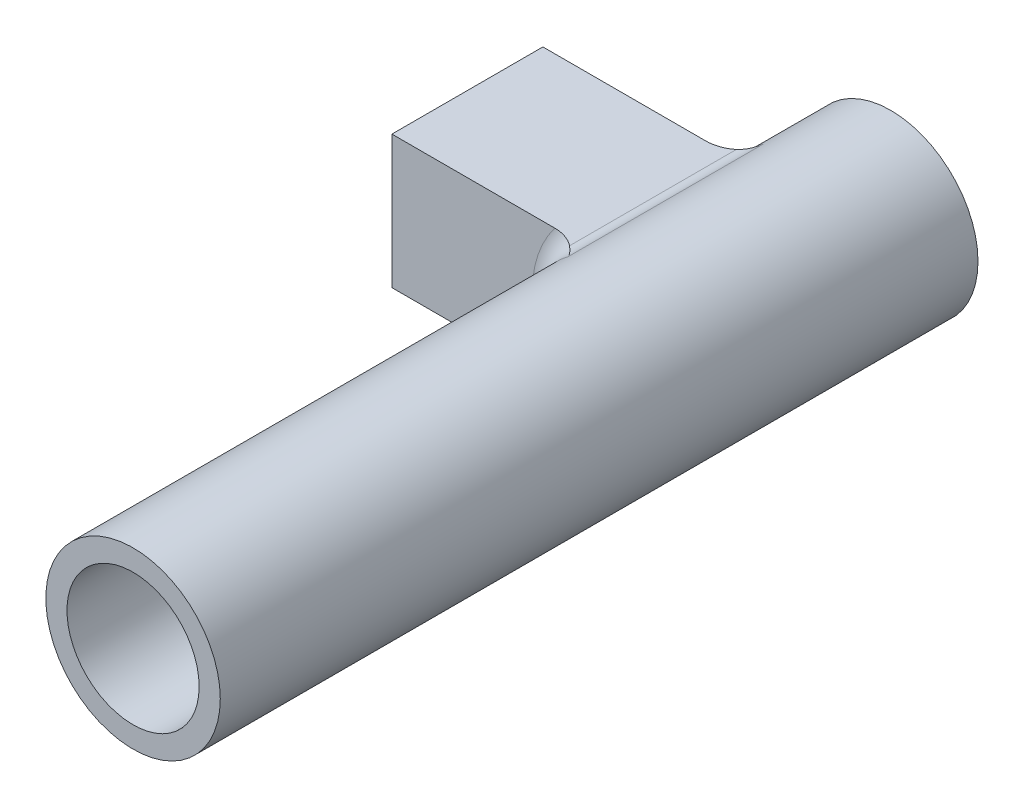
ISO-10303-21;
HEADER;
FILE_DESCRIPTION(('STEP AP214'),'2;1');
FILE_NAME('part.step','',(''),(''),'','','');
FILE_SCHEMA(('AUTOMOTIVE_DESIGN { 1 0 10303 214 1 1 1 1 }'));
ENDSEC;
DATA;
#1=APPLICATION_CONTEXT('core data for automotive mechanical design processes');
#2=APPLICATION_PROTOCOL_DEFINITION('international standard','automotive_design',2000,#1);
#3=PRODUCT_CONTEXT('',#1,'mechanical');
#4=PRODUCT('Part','Part','',(#3));
#5=PRODUCT_RELATED_PRODUCT_CATEGORY('part','',(#4));
#6=PRODUCT_DEFINITION_FORMATION('','',#4);
#7=PRODUCT_DEFINITION_CONTEXT('part definition',#1,'design');
#8=PRODUCT_DEFINITION('design','',#6,#7);
#9=PRODUCT_DEFINITION_SHAPE('','',#8);
#10=(LENGTH_UNIT() NAMED_UNIT(*) SI_UNIT(.MILLI.,.METRE.));
#11=(NAMED_UNIT(*) PLANE_ANGLE_UNIT() SI_UNIT($,.RADIAN.));
#12=(NAMED_UNIT(*) SI_UNIT($,.STERADIAN.) SOLID_ANGLE_UNIT());
#13=UNCERTAINTY_MEASURE_WITH_UNIT(LENGTH_MEASURE(1.E-05),#10,'distance_accuracy_value','');
#14=(GEOMETRIC_REPRESENTATION_CONTEXT(3) GLOBAL_UNCERTAINTY_ASSIGNED_CONTEXT((#13)) GLOBAL_UNIT_ASSIGNED_CONTEXT((#10,
#11,#12)) REPRESENTATION_CONTEXT('',''));
#15=CARTESIAN_POINT('',(0.,0.,0.));
#16=DIRECTION('',(0.,0.,1.));
#17=DIRECTION('',(1.,0.,0.));
#18=AXIS2_PLACEMENT_3D('',#15,#16,#17);
#19=CARTESIAN_POINT('',(0.,0.,-114.511506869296));
#20=DIRECTION('',(0.,0.,1.));
#21=DIRECTION('',(1.,0.,0.));
#22=AXIS2_PLACEMENT_3D('',#19,#20,#21);
#23=CYLINDRICAL_SURFACE('',#22,19.8);
#24=CARTESIAN_POINT('',(0.,0.,-54.9188622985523));
#25=DIRECTION('',(0.,0.,1.));
#26=DIRECTION('',(1.,0.,0.));
#27=AXIS2_PLACEMENT_3D('',#24,#25,#26);
#28=CIRCLE('',#27,19.8);
#29=CARTESIAN_POINT('',(-11.6016156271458,16.0450152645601,-54.9188622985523));
#30=VERTEX_POINT('',#29);
#31=CARTESIAN_POINT('',(-11.6016156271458,-16.0450152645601,-54.9188622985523));
#32=VERTEX_POINT('',#31);
#33=EDGE_CURVE('E179',#30,#32,#28,.T.);
#34=ORIENTED_EDGE('',*,*,#33,.T.);
#35=DIRECTION('',(0.,0.,1.));
#36=VECTOR('',#35,1.);
#37=CARTESIAN_POINT('',(-11.6016156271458,-16.0450152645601,-114.511506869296));
#38=LINE('',#37,#36);
#39=CARTESIAN_POINT('',(-11.6016156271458,-16.0450152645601,-99.1921994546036));
#40=VERTEX_POINT('',#39);
#41=EDGE_CURVE('E181',#32,#40,#38,.F.);
#42=ORIENTED_EDGE('',*,*,#41,.T.);
#43=CARTESIAN_POINT('',(0.,0.,-99.1921994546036));
#44=DIRECTION('',(0.,0.,-1.));
#45=DIRECTION('',(-1.,0.,0.));
#46=AXIS2_PLACEMENT_3D('',#43,#44,#45);
#47=CIRCLE('',#46,19.8);
#48=CARTESIAN_POINT('',(-11.6016156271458,16.0450152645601,-99.1921994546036));
#49=VERTEX_POINT('',#48);
#50=EDGE_CURVE('E177',#40,#49,#47,.T.);
#51=ORIENTED_EDGE('',*,*,#50,.T.);
#52=DIRECTION('',(0.,0.,1.));
#53=VECTOR('',#52,1.);
#54=CARTESIAN_POINT('',(-11.6016156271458,16.0450152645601,-114.511506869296));
#55=LINE('',#54,#53);
#56=EDGE_CURVE('E175',#49,#30,#55,.T.);
#57=ORIENTED_EDGE('',*,*,#56,.T.);
#58=EDGE_LOOP('',(#34,#42,#51,#57));
#59=FACE_BOUND('',#58,.T.);
#60=CARTESIAN_POINT('',(0.,0.,55.4884931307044));
#61=DIRECTION('',(0.,0.,1.));
#62=DIRECTION('',(1.,0.,0.));
#63=AXIS2_PLACEMENT_3D('',#60,#61,#62);
#64=CIRCLE('',#63,19.8);
#65=CARTESIAN_POINT('',(19.8,0.,55.4884931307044));
#66=VERTEX_POINT('',#65);
#67=EDGE_CURVE('E164',#66,#66,#64,.T.);
#68=ORIENTED_EDGE('',*,*,#67,.F.);
#69=EDGE_LOOP('',(#68));
#70=FACE_BOUND('',#69,.T.);
#71=CARTESIAN_POINT('',(0.,0.,-116.511506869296));
#72=DIRECTION('',(0.,0.,-1.));
#73=DIRECTION('',(-1.,0.,0.));
#74=AXIS2_PLACEMENT_3D('',#71,#72,#73);
#75=CIRCLE('',#74,19.8);
#76=CARTESIAN_POINT('',(-19.8,0.,-116.511506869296));
#77=VERTEX_POINT('',#76);
#78=EDGE_CURVE('E145',#77,#77,#75,.T.);
#79=ORIENTED_EDGE('',*,*,#78,.F.);
#80=EDGE_LOOP('',(#79));
#81=FACE_BOUND('',#80,.T.);
#82=ADVANCED_FACE('F51',(#59,#70,#81),#23,.T.);
#83=CARTESIAN_POINT('',(0.,0.,55.4884931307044));
#84=DIRECTION('',(0.,0.,1.));
#85=DIRECTION('',(1.,0.,0.));
#86=AXIS2_PLACEMENT_3D('',#83,#84,#85);
#87=PLANE('',#86);
#88=CARTESIAN_POINT('',(0.,0.,55.4884931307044));
#89=DIRECTION('',(0.,0.,1.));
#90=DIRECTION('',(1.,0.,0.));
#91=AXIS2_PLACEMENT_3D('',#88,#89,#90);
#92=CIRCLE('',#91,15.);
#93=CARTESIAN_POINT('',(15.,0.,55.4884931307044));
#94=VERTEX_POINT('',#93);
#95=EDGE_CURVE('E149',#94,#94,#92,.T.);
#96=ORIENTED_EDGE('',*,*,#95,.F.);
#97=EDGE_LOOP('',(#96));
#98=FACE_BOUND('',#97,.T.);
#99=ORIENTED_EDGE('',*,*,#67,.T.);
#100=EDGE_LOOP('',(#99));
#101=FACE_BOUND('',#100,.T.);
#102=ADVANCED_FACE('F305',(#98,#101),#87,.T.);
#103=CARTESIAN_POINT('',(0.,0.,-114.511506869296));
#104=DIRECTION('',(0.,0.,1.));
#105=DIRECTION('',(1.,0.,0.));
#106=AXIS2_PLACEMENT_3D('',#103,#104,#105);
#107=CYLINDRICAL_SURFACE('',#106,15.);
#108=CARTESIAN_POINT('',(0.,0.,-114.511506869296));
#109=DIRECTION('',(0.,0.,1.));
#110=DIRECTION('',(1.,0.,0.));
#111=AXIS2_PLACEMENT_3D('',#108,#109,#110);
#112=CIRCLE('',#111,15.);
#113=CARTESIAN_POINT('',(15.,0.,-114.511506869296));
#114=VERTEX_POINT('',#113);
#115=EDGE_CURVE('E166',#114,#114,#112,.T.);
#116=ORIENTED_EDGE('',*,*,#115,.F.);
#117=EDGE_LOOP('',(#116));
#118=FACE_BOUND('',#117,.T.);
#119=ORIENTED_EDGE('',*,*,#95,.T.);
#120=EDGE_LOOP('',(#119));
#121=FACE_BOUND('',#120,.T.);
#122=ADVANCED_FACE('F301',(#118,#121),#107,.F.);
#123=CARTESIAN_POINT('',(0.,0.,-114.511506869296));
#124=DIRECTION('',(0.,0.,-1.));
#125=DIRECTION('',(-1.,0.,0.));
#126=AXIS2_PLACEMENT_3D('',#123,#124,#125);
#127=PLANE('',#126);
#128=ORIENTED_EDGE('',*,*,#115,.T.);
#129=EDGE_LOOP('',(#128));
#130=FACE_BOUND('',#129,.T.);
#131=ADVANCED_FACE('F297',(#130),#127,.F.);
#132=CARTESIAN_POINT('',(0.,0.,-116.511506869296));
#133=DIRECTION('',(0.,0.,-1.));
#134=DIRECTION('',(-1.,0.,0.));
#135=AXIS2_PLACEMENT_3D('',#132,#133,#134);
#136=PLANE('',#135);
#137=CARTESIAN_POINT('',(0.,0.,-116.511506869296));
#138=DIRECTION('',(0.,0.,-1.));
#139=DIRECTION('',(-1.,0.,0.));
#140=AXIS2_PLACEMENT_3D('',#137,#138,#139);
#141=CIRCLE('',#140,12.);
#142=CARTESIAN_POINT('',(-12.,0.,-116.511506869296));
#143=VERTEX_POINT('',#142);
#144=EDGE_CURVE('E161',#143,#143,#141,.T.);
#145=ORIENTED_EDGE('',*,*,#144,.F.);
#146=EDGE_LOOP('',(#145));
#147=FACE_BOUND('',#146,.T.);
#148=ORIENTED_EDGE('',*,*,#78,.T.);
#149=EDGE_LOOP('',(#148));
#150=FACE_BOUND('',#149,.T.);
#151=ADVANCED_FACE('F293',(#147,#150),#136,.T.);
#152=CARTESIAN_POINT('',(0.,0.,-117.511506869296));
#153=DIRECTION('',(0.,0.,-1.));
#154=DIRECTION('',(-1.,0.,0.));
#155=AXIS2_PLACEMENT_3D('',#152,#153,#154);
#156=PLANE('',#155);
#157=CARTESIAN_POINT('',(0.,0.,-117.511506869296));
#158=DIRECTION('',(0.,0.,-1.));
#159=DIRECTION('',(-1.,0.,0.));
#160=AXIS2_PLACEMENT_3D('',#157,#158,#159);
#161=CIRCLE('',#160,11.);
#162=CARTESIAN_POINT('',(-11.,0.,-117.511506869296));
#163=VERTEX_POINT('',#162);
#164=EDGE_CURVE('E163',#163,#163,#161,.T.);
#165=ORIENTED_EDGE('',*,*,#164,.T.);
#166=EDGE_LOOP('',(#165));
#167=FACE_BOUND('',#166,.T.);
#168=ADVANCED_FACE('F289',(#167),#156,.T.);
#169=CARTESIAN_POINT('',(0.,0.,-116.511506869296));
#170=DIRECTION('',(0.,0.,-1.));
#171=DIRECTION('',(-1.,0.,0.));
#172=AXIS2_PLACEMENT_3D('',#169,#170,#171);
#173=TOROIDAL_SURFACE('',#172,11.,1.);
#174=ORIENTED_EDGE('',*,*,#144,.T.);
#175=EDGE_LOOP('',(#174));
#176=FACE_BOUND('',#175,.T.);
#177=ORIENTED_EDGE('',*,*,#164,.F.);
#178=EDGE_LOOP('',(#177));
#179=FACE_BOUND('',#178,.T.);
#180=ADVANCED_FACE('F214',(#176,#179),#173,.T.);
#181=CARTESIAN_POINT('',(19.802,-15.0967867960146,-59.9188622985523));
#182=DIRECTION('',(0.,-1.,0.));
#183=DIRECTION('',(0.,0.,-1.));
#184=AXIS2_PLACEMENT_3D('',#181,#182,#183);
#185=PLANE('',#184);
#186=DIRECTION('',(-1.,0.,0.));
#187=VECTOR('',#186,1.);
#188=CARTESIAN_POINT('',(19.802,-15.0967867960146,-94.1921994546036));
#189=LINE('',#188,#187);
#190=CARTESIAN_POINT('',(-19.6755439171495,-15.0967867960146,-94.1921994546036));
#191=VERTEX_POINT('',#190);
#192=CARTESIAN_POINT('',(-56.6507586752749,-15.0967867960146,-94.1921994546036));
#193=VERTEX_POINT('',#192);
#194=EDGE_CURVE('E143',#191,#193,#189,.T.);
#195=ORIENTED_EDGE('',*,*,#194,.F.);
#196=CARTESIAN_POINT('',(-19.6755439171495,-15.0967867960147,-94.1921994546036));
#197=CARTESIAN_POINT('',(-19.4610063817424,-15.0967867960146,-94.1922248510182));
#198=CARTESIAN_POINT('',(-19.2466148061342,-15.0967867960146,-94.2008908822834));
#199=CARTESIAN_POINT('',(-18.8192965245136,-15.0967867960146,-94.2349813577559));
#200=CARTESIAN_POINT('',(-18.6063689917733,-15.0967867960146,-94.2603953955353));
#201=CARTESIAN_POINT('',(-17.9820601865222,-15.0967867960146,-94.3592633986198));
#202=CARTESIAN_POINT('',(-17.5739910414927,-15.0967867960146,-94.4554194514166));
#203=CARTESIAN_POINT('',(-16.9392228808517,-15.0967867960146,-94.6552380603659));
#204=CARTESIAN_POINT('',(-16.7062866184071,-15.0967867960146,-94.7399263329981));
#205=CARTESIAN_POINT('',(-16.2488265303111,-15.0967867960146,-94.9297562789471));
#206=CARTESIAN_POINT('',(-16.0243003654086,-15.0967867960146,-95.0348922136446));
#207=CARTESIAN_POINT('',(-15.692297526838,-15.0967867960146,-95.2097132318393));
#208=CARTESIAN_POINT('',(-15.5808106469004,-15.0967867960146,-95.2718979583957));
#209=CARTESIAN_POINT('',(-15.3610838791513,-15.0967867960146,-95.4017627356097));
#210=CARTESIAN_POINT('',(-15.2528436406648,-15.0967867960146,-95.4694421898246));
#211=CARTESIAN_POINT('',(-15.0399016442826,-15.0967867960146,-95.6104515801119));
#212=CARTESIAN_POINT('',(-14.9352045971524,-15.0967867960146,-95.6837886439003));
#213=CARTESIAN_POINT('',(-14.7299858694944,-15.0967867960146,-95.8361557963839));
#214=CARTESIAN_POINT('',(-14.6294656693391,-15.0967867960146,-95.915187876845));
#215=CARTESIAN_POINT('',(-14.5313165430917,-15.0967867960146,-95.9971010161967));
#216=B_SPLINE_CURVE_WITH_KNOTS('',3,(#196,#197,#198,#199,#200,#201,#202,#203,#204,#205,#206,
#207,#208,#209,#210,#211,#212,#213,#214,#215),.UNSPECIFIED.,.F.,.F.,(4,2,2,2,2,2,2,2,2,4),(0.,
0.643169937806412,1.28594061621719,2.53833162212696,3.28113116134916,4.023722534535,
4.40656574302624,4.78936745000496,5.17265956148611,5.55608638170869),.UNSPECIFIED.);
#217=CARTESIAN_POINT('',(-14.5313165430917,-15.0967867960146,-95.9971010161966));
#218=VERTEX_POINT('',#217);
#219=EDGE_CURVE('E12',#191,#218,#216,.T.);
#220=ORIENTED_EDGE('',*,*,#219,.T.);
#221=DIRECTION('',(0.,0.,-1.));
#222=VECTOR('',#221,1.);
#223=CARTESIAN_POINT('',(-14.5313165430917,-15.0967867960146,-59.9188622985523));
#224=LINE('',#223,#222);
#225=CARTESIAN_POINT('',(-14.5313165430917,-15.0967867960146,-58.1139607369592));
#226=VERTEX_POINT('',#225);
#227=EDGE_CURVE('E184',#218,#226,#224,.F.);
#228=ORIENTED_EDGE('',*,*,#227,.T.);
#229=CARTESIAN_POINT('',(-14.5313165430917,-15.0967867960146,-58.1139607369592));
#230=CARTESIAN_POINT('',(-14.6129495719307,-15.0967867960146,-58.18209596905));
#231=CARTESIAN_POINT('',(-14.696221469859,-15.0967867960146,-58.2482297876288));
#232=CARTESIAN_POINT('',(-14.8657255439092,-15.0967867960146,-58.3765494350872));
#233=CARTESIAN_POINT('',(-14.9519570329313,-15.0967867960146,-58.438736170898));
#234=CARTESIAN_POINT('',(-15.2144738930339,-15.0967867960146,-58.6193669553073));
#235=CARTESIAN_POINT('',(-15.3947682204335,-15.0967867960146,-58.7320358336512));
#236=CARTESIAN_POINT('',(-15.7640678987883,-15.0967867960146,-58.9422679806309));
#237=CARTESIAN_POINT('',(-15.9530796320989,-15.0967867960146,-59.0398199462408));
#238=CARTESIAN_POINT('',(-16.3381774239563,-15.0967867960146,-59.21989867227));
#239=CARTESIAN_POINT('',(-16.534265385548,-15.0967867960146,-59.3024213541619));
#240=CARTESIAN_POINT('',(-16.9325711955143,-15.0967867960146,-59.4525273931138));
#241=CARTESIAN_POINT('',(-17.1348012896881,-15.0967867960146,-59.5200783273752));
#242=CARTESIAN_POINT('',(-17.5437686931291,-15.0967867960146,-59.6398270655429));
#243=CARTESIAN_POINT('',(-17.750507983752,-15.0967867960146,-59.6920179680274));
#244=CARTESIAN_POINT('',(-18.3749851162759,-15.0967867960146,-59.8248141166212));
#245=CARTESIAN_POINT('',(-18.7981663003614,-15.0967867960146,-59.8820879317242));
#246=CARTESIAN_POINT('',(-19.2979897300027,-15.0967867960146,-59.9102992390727));
#247=CARTESIAN_POINT('',(-19.3734993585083,-15.0967867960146,-59.9135050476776));
#248=CARTESIAN_POINT('',(-19.5245129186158,-15.0967867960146,-59.917784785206));
#249=CARTESIAN_POINT('',(-19.600016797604,-15.0967867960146,-59.9188605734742));
#250=CARTESIAN_POINT('',(-19.6755439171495,-15.0967867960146,-59.9188622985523));
#251=B_SPLINE_CURVE_WITH_KNOTS('',3,(#229,#230,#231,#232,#233,#234,#235,#236,#237,#238,#239,
#240,#241,#242,#243,#244,#245,#246,#247,#248,#249,#250),.UNSPECIFIED.,.F.,.F.,(4,2,2,2,2,2,2,2,
2,2,4),(0.,0.31892073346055,0.637767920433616,1.2747387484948,1.91218356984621,2.54980111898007,
3.18878628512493,3.82805811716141,5.10284079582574,5.32956642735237,5.55609405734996),.UNSPECIFIED.);
#252=CARTESIAN_POINT('',(-19.6755439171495,-15.0967867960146,-59.9188622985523));
#253=VERTEX_POINT('',#252);
#254=EDGE_CURVE('E191',#226,#253,#251,.T.);
#255=ORIENTED_EDGE('',*,*,#254,.T.);
#256=DIRECTION('',(-1.,0.,0.));
#257=VECTOR('',#256,1.);
#258=CARTESIAN_POINT('',(19.802,-15.0967867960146,-59.9188622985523));
#259=LINE('',#258,#257);
#260=CARTESIAN_POINT('',(-56.6507586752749,-15.0967867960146,-59.9188622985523));
#261=VERTEX_POINT('',#260);
#262=EDGE_CURVE('E157',#253,#261,#259,.T.);
#263=ORIENTED_EDGE('',*,*,#262,.T.);
#264=DIRECTION('',(0.,0.,1.));
#265=VECTOR('',#264,1.);
#266=CARTESIAN_POINT('',(-56.6507586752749,-15.0967867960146,-59.9188622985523));
#267=LINE('',#266,#265);
#268=EDGE_CURVE('E146',#193,#261,#267,.T.);
#269=ORIENTED_EDGE('',*,*,#268,.F.);
#270=EDGE_LOOP('',(#195,#220,#228,#255,#263,#269));
#271=FACE_BOUND('',#270,.T.);
#272=ADVANCED_FACE('F208',(#271),#185,.T.);
#273=CARTESIAN_POINT('',(19.802,15.0967867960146,-59.9188622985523));
#274=DIRECTION('',(0.,0.,1.));
#275=DIRECTION('',(1.,0.,0.));
#276=AXIS2_PLACEMENT_3D('',#273,#274,#275);
#277=PLANE('',#276);
#278=ORIENTED_EDGE('',*,*,#262,.F.);
#279=CARTESIAN_POINT('',(0.,0.,-59.9188622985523));
#280=DIRECTION('',(0.,0.,1.));
#281=DIRECTION('',(1.,0.,0.));
#282=AXIS2_PLACEMENT_3D('',#279,#280,#281);
#283=CIRCLE('',#282,24.8);
#284=CARTESIAN_POINT('',(-19.6755439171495,15.0967867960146,-59.9188622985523));
#285=VERTEX_POINT('',#284);
#286=EDGE_CURVE('E186',#253,#285,#283,.F.);
#287=ORIENTED_EDGE('',*,*,#286,.T.);
#288=DIRECTION('',(-1.,0.,0.));
#289=VECTOR('',#288,1.);
#290=CARTESIAN_POINT('',(19.802,15.0967867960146,-59.9188622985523));
#291=LINE('',#290,#289);
#292=CARTESIAN_POINT('',(-56.6507586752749,15.0967867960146,-59.9188622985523));
#293=VERTEX_POINT('',#292);
#294=EDGE_CURVE('E131',#285,#293,#291,.T.);
#295=ORIENTED_EDGE('',*,*,#294,.T.);
#296=DIRECTION('',(0.,1.,0.));
#297=VECTOR('',#296,1.);
#298=CARTESIAN_POINT('',(-56.6507586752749,15.0967867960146,-59.9188622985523));
#299=LINE('',#298,#297);
#300=EDGE_CURVE('E139',#261,#293,#299,.T.);
#301=ORIENTED_EDGE('',*,*,#300,.F.);
#302=EDGE_LOOP('',(#278,#287,#295,#301));
#303=FACE_BOUND('',#302,.T.);
#304=ADVANCED_FACE('F213',(#303),#277,.T.);
#305=CARTESIAN_POINT('',(-56.6507586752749,0.,0.));
#306=DIRECTION('',(1.,0.,0.));
#307=DIRECTION('',(0.,0.,-1.));
#308=AXIS2_PLACEMENT_3D('',#305,#306,#307);
#309=PLANE('',#308);
#310=CARTESIAN_POINT('',(-56.6507586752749,0.,-77.0555308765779));
#311=DIRECTION('',(-1.,0.,0.));
#312=DIRECTION('',(0.,0.,1.));
#313=AXIS2_PLACEMENT_3D('',#310,#311,#312);
#314=CIRCLE('',#313,12.5);
#315=CARTESIAN_POINT('',(-56.6507586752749,0.,-64.5555308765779));
#316=VERTEX_POINT('',#315);
#317=EDGE_CURVE('E130',#316,#316,#314,.T.);
#318=ORIENTED_EDGE('',*,*,#317,.F.);
#319=EDGE_LOOP('',(#318));
#320=FACE_BOUND('',#319,.T.);
#321=DIRECTION('',(0.,-1.,0.));
#322=VECTOR('',#321,1.);
#323=CARTESIAN_POINT('',(-56.6507586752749,15.0967867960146,-94.1921994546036));
#324=LINE('',#323,#322);
#325=CARTESIAN_POINT('',(-56.6507586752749,15.0967867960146,-94.1921994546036));
#326=VERTEX_POINT('',#325);
#327=EDGE_CURVE('E137',#326,#193,#324,.T.);
#328=ORIENTED_EDGE('',*,*,#327,.T.);
#329=ORIENTED_EDGE('',*,*,#268,.T.);
#330=ORIENTED_EDGE('',*,*,#300,.T.);
#331=DIRECTION('',(0.,0.,-1.));
#332=VECTOR('',#331,1.);
#333=CARTESIAN_POINT('',(-56.6507586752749,15.0967867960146,-59.9188622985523));
#334=LINE('',#333,#332);
#335=EDGE_CURVE('E124',#293,#326,#334,.T.);
#336=ORIENTED_EDGE('',*,*,#335,.T.);
#337=EDGE_LOOP('',(#328,#329,#330,#336));
#338=FACE_BOUND('',#337,.T.);
#339=ADVANCED_FACE('F135',(#320,#338),#309,.F.);
#340=CARTESIAN_POINT('',(19.802,15.0967867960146,-94.1921994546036));
#341=DIRECTION('',(0.,0.,-1.));
#342=DIRECTION('',(-1.,0.,0.));
#343=AXIS2_PLACEMENT_3D('',#340,#341,#342);
#344=PLANE('',#343);
#345=DIRECTION('',(-1.,0.,0.));
#346=VECTOR('',#345,1.);
#347=CARTESIAN_POINT('',(19.802,15.0967867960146,-94.1921994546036));
#348=LINE('',#347,#346);
#349=CARTESIAN_POINT('',(-19.6755439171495,15.0967867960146,-94.1921994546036));
#350=VERTEX_POINT('',#349);
#351=EDGE_CURVE('E120',#350,#326,#348,.T.);
#352=ORIENTED_EDGE('',*,*,#351,.F.);
#353=CARTESIAN_POINT('',(0.,0.,-94.1921994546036));
#354=DIRECTION('',(0.,0.,-1.));
#355=DIRECTION('',(-1.,0.,0.));
#356=AXIS2_PLACEMENT_3D('',#353,#354,#355);
#357=CIRCLE('',#356,24.8);
#358=EDGE_CURVE('E188',#350,#191,#357,.F.);
#359=ORIENTED_EDGE('',*,*,#358,.T.);
#360=ORIENTED_EDGE('',*,*,#194,.T.);
#361=ORIENTED_EDGE('',*,*,#327,.F.);
#362=EDGE_LOOP('',(#352,#359,#360,#361));
#363=FACE_BOUND('',#362,.T.);
#364=ADVANCED_FACE('F141',(#363),#344,.T.);
#365=CARTESIAN_POINT('',(19.802,15.0967867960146,-59.9188622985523));
#366=DIRECTION('',(0.,1.,0.));
#367=DIRECTION('',(0.,0.,1.));
#368=AXIS2_PLACEMENT_3D('',#365,#366,#367);
#369=PLANE('',#368);
#370=CARTESIAN_POINT('',(-19.6755439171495,15.0967867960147,-59.9188622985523));
#371=CARTESIAN_POINT('',(-19.4610063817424,15.0967867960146,-59.9188369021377));
#372=CARTESIAN_POINT('',(-19.2466148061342,15.0967867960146,-59.9101708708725));
#373=CARTESIAN_POINT('',(-18.8192965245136,15.0967867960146,-59.8760803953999));
#374=CARTESIAN_POINT('',(-18.6063689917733,15.0967867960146,-59.8506663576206));
#375=CARTESIAN_POINT('',(-17.9820601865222,15.0967867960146,-59.751798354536));
#376=CARTESIAN_POINT('',(-17.5739910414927,15.0967867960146,-59.6556423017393));
#377=CARTESIAN_POINT('',(-16.9392228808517,15.0967867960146,-59.4558236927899));
#378=CARTESIAN_POINT('',(-16.7062866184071,15.0967867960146,-59.3711354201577));
#379=CARTESIAN_POINT('',(-16.2488265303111,15.0967867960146,-59.1813054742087));
#380=CARTESIAN_POINT('',(-16.0243003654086,15.0967867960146,-59.0761695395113));
#381=CARTESIAN_POINT('',(-15.692297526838,15.0967867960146,-58.9013485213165));
#382=CARTESIAN_POINT('',(-15.5808106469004,15.0967867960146,-58.8391637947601));
#383=CARTESIAN_POINT('',(-15.3610838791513,15.0967867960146,-58.7092990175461));
#384=CARTESIAN_POINT('',(-15.2528436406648,15.0967867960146,-58.6416195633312));
#385=CARTESIAN_POINT('',(-15.0399016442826,15.0967867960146,-58.5006101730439));
#386=CARTESIAN_POINT('',(-14.9352045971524,15.0967867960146,-58.4272731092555));
#387=CARTESIAN_POINT('',(-14.7299858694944,15.0967867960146,-58.2749059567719));
#388=CARTESIAN_POINT('',(-14.6294656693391,15.0967867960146,-58.1958738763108));
#389=CARTESIAN_POINT('',(-14.5313165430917,15.0967867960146,-58.1139607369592));
#390=B_SPLINE_CURVE_WITH_KNOTS('',3,(#370,#371,#372,#373,#374,#375,#376,#377,#378,#379,#380,
#381,#382,#383,#384,#385,#386,#387,#388,#389),.UNSPECIFIED.,.F.,.F.,(4,2,2,2,2,2,2,2,2,4),(0.,
0.643169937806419,1.28594061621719,2.53833162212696,3.28113116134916,4.02372253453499,
4.40656574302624,4.78936745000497,5.17265956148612,5.55608638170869),.UNSPECIFIED.);
#391=CARTESIAN_POINT('',(-14.5313165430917,15.0967867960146,-58.1139607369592));
#392=VERTEX_POINT('',#391);
#393=EDGE_CURVE('E198',#285,#392,#390,.T.);
#394=ORIENTED_EDGE('',*,*,#393,.T.);
#395=DIRECTION('',(0.,0.,-1.));
#396=VECTOR('',#395,1.);
#397=CARTESIAN_POINT('',(-14.5313165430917,15.0967867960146,-94.1921994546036));
#398=LINE('',#397,#396);
#399=CARTESIAN_POINT('',(-14.5313165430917,15.0967867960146,-95.9971010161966));
#400=VERTEX_POINT('',#399);
#401=EDGE_CURVE('E73',#392,#400,#398,.T.);
#402=ORIENTED_EDGE('',*,*,#401,.T.);
#403=CARTESIAN_POINT('',(-14.5313165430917,15.0967867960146,-95.9971010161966));
#404=CARTESIAN_POINT('',(-14.6129495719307,15.0967867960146,-95.9289657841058));
#405=CARTESIAN_POINT('',(-14.696221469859,15.0967867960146,-95.8628319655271));
#406=CARTESIAN_POINT('',(-14.8657255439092,15.0967867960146,-95.7345123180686));
#407=CARTESIAN_POINT('',(-14.9519570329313,15.0967867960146,-95.6723255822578));
#408=CARTESIAN_POINT('',(-15.214473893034,15.0967867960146,-95.4916947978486));
#409=CARTESIAN_POINT('',(-15.3947682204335,15.0967867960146,-95.3790259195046));
#410=CARTESIAN_POINT('',(-15.7640678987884,15.0967867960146,-95.1687937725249));
#411=CARTESIAN_POINT('',(-15.9530796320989,15.0967867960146,-95.0712418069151));
#412=CARTESIAN_POINT('',(-16.3381774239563,15.0967867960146,-94.8911630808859));
#413=CARTESIAN_POINT('',(-16.534265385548,15.0967867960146,-94.8086403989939));
#414=CARTESIAN_POINT('',(-16.9325711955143,15.0967867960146,-94.658534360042));
#415=CARTESIAN_POINT('',(-17.1348012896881,15.0967867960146,-94.5909834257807));
#416=CARTESIAN_POINT('',(-17.5437686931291,15.0967867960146,-94.4712346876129));
#417=CARTESIAN_POINT('',(-17.750507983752,15.0967867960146,-94.4190437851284));
#418=CARTESIAN_POINT('',(-18.3749851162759,15.0967867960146,-94.2862476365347));
#419=CARTESIAN_POINT('',(-18.7981663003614,15.0967867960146,-94.2289738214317));
#420=CARTESIAN_POINT('',(-19.2979897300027,15.0967867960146,-94.2007625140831));
#421=CARTESIAN_POINT('',(-19.3734993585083,15.0967867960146,-94.1975567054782));
#422=CARTESIAN_POINT('',(-19.5245129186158,15.0967867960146,-94.1932769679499));
#423=CARTESIAN_POINT('',(-19.600016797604,15.0967867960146,-94.1922011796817));
#424=CARTESIAN_POINT('',(-19.6755439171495,15.0967867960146,-94.1921994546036));
#425=B_SPLINE_CURVE_WITH_KNOTS('',3,(#403,#404,#405,#406,#407,#408,#409,#410,#411,#412,#413,
#414,#415,#416,#417,#418,#419,#420,#421,#422,#423,#424),.UNSPECIFIED.,.F.,.F.,(4,2,2,2,2,2,2,2,
2,2,4),(0.,0.318920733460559,0.637767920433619,1.2747387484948,1.91218356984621,
2.54980111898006,3.18878628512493,3.8280581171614,5.10284079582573,5.32956642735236,
5.55609405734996),.UNSPECIFIED.);
#426=EDGE_CURVE('E65',#400,#350,#425,.T.);
#427=ORIENTED_EDGE('',*,*,#426,.T.);
#428=ORIENTED_EDGE('',*,*,#351,.T.);
#429=ORIENTED_EDGE('',*,*,#335,.F.);
#430=ORIENTED_EDGE('',*,*,#294,.F.);
#431=EDGE_LOOP('',(#394,#402,#427,#428,#429,#430));
#432=FACE_BOUND('',#431,.T.);
#433=ADVANCED_FACE('F122',(#432),#369,.T.);
#434=CARTESIAN_POINT('',(19.802,0.,-77.0555308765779));
#435=DIRECTION('',(-1.,0.,0.));
#436=DIRECTION('',(0.,0.,1.));
#437=AXIS2_PLACEMENT_3D('',#434,#435,#436);
#438=CYLINDRICAL_SURFACE('',#437,12.5);
#439=CARTESIAN_POINT('',(-19.8,0.,-64.5555308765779));
#440=CARTESIAN_POINT('',(-19.8000001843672,-0.317143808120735,-64.5555306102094));
#441=CARTESIAN_POINT('',(-19.7923640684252,-0.634287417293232,-64.5676156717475));
#442=CARTESIAN_POINT('',(-19.7620084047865,-1.26613839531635,-64.6157830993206));
#443=CARTESIAN_POINT('',(-19.7392828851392,-1.58084474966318,-64.6518749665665));
#444=CARTESIAN_POINT('',(-19.6792642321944,-2.20572935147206,-64.7476134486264));
#445=CARTESIAN_POINT('',(-19.641948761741,-2.51589989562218,-64.8072961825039));
#446=CARTESIAN_POINT('',(-19.5536582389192,-3.1289554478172,-64.9493900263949));
#447=CARTESIAN_POINT('',(-19.5026843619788,-3.43184108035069,-65.0317991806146));
#448=CARTESIAN_POINT('',(-19.3885348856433,-4.02691669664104,-65.2178515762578));
#449=CARTESIAN_POINT('',(-19.3254214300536,-4.31915250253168,-65.3213868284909));
#450=CARTESIAN_POINT('',(-19.1881866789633,-4.89290429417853,-65.5488055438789));
#451=CARTESIAN_POINT('',(-19.114065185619,-5.17442008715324,-65.6726893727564));
#452=CARTESIAN_POINT('',(-18.9563420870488,-5.7253088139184,-65.939574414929));
#453=CARTESIAN_POINT('',(-18.8727441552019,-5.99468639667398,-66.0825682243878));
#454=CARTESIAN_POINT('',(-18.6976037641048,-6.52046271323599,-66.3866118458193));
#455=CARTESIAN_POINT('',(-18.6060583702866,-6.77685659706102,-66.5476683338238));
#456=CARTESIAN_POINT('',(-18.4090782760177,-7.29581617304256,-66.9003716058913));
#457=CARTESIAN_POINT('',(-18.3031186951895,-7.55721836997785,-67.0934370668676));
#458=CARTESIAN_POINT('',(-18.0860382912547,-8.06293700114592,-67.4981281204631));
#459=CARTESIAN_POINT('',(-17.974917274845,-8.30725279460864,-67.7097544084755));
#460=CARTESIAN_POINT('',(-17.7495823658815,-8.77841738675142,-68.1508313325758));
#461=CARTESIAN_POINT('',(-17.6353642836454,-9.0052407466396,-68.3803069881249));
#462=CARTESIAN_POINT('',(-17.4063575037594,-9.44029351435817,-68.8558542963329));
#463=CARTESIAN_POINT('',(-17.2915689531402,-9.64852747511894,-69.1019218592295));
#464=CARTESIAN_POINT('',(-17.0480078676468,-10.0734012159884,-69.6453011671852));
#465=CARTESIAN_POINT('',(-16.9195106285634,-10.2871826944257,-69.9449803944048));
#466=CARTESIAN_POINT('',(-16.668835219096,-10.6885895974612,-70.5639867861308));
#467=CARTESIAN_POINT('',(-16.5466582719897,-10.8762099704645,-70.8833177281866));
#468=CARTESIAN_POINT('',(-16.3130859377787,-11.2235006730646,-71.5400244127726));
#469=CARTESIAN_POINT('',(-16.2016760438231,-11.3832088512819,-71.8773748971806));
#470=CARTESIAN_POINT('',(-15.9940769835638,-11.6731023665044,-72.568982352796));
#471=CARTESIAN_POINT('',(-15.897881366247,-11.8033002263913,-72.9232320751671));
#472=CARTESIAN_POINT('',(-15.7481662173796,-12.0019324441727,-73.5510185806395));
#473=CARTESIAN_POINT('',(-15.6900829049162,-12.0775995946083,-73.8211966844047));
#474=CARTESIAN_POINT('',(-15.5865061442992,-12.2109775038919,-74.3682924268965));
#475=CARTESIAN_POINT('',(-15.5410095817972,-12.2686927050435,-74.6452083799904));
#476=CARTESIAN_POINT('',(-15.4642183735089,-12.365345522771,-75.2039100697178));
#477=CARTESIAN_POINT('',(-15.4329066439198,-12.4043057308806,-75.4856895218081));
#478=CARTESIAN_POINT('',(-15.3855852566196,-12.4629530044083,-76.0525444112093));
#479=CARTESIAN_POINT('',(-15.3695757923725,-12.4826398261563,-76.3376198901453));
#480=CARTESIAN_POINT('',(-15.3534777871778,-12.5024352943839,-76.9097162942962));
#481=CARTESIAN_POINT('',(-15.353434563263,-12.5024882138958,-77.1967404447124));
#482=CARTESIAN_POINT('',(-15.3693844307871,-12.4828753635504,-77.76966153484));
#483=CARTESIAN_POINT('',(-15.3853776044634,-12.463209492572,-78.0555584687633));
#484=CARTESIAN_POINT('',(-15.4327736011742,-12.4044714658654,-78.6242469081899));
#485=CARTESIAN_POINT('',(-15.464187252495,-12.3653856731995,-78.9070360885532));
#486=CARTESIAN_POINT('',(-15.5412351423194,-12.2684078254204,-79.4673832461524));
#487=CARTESIAN_POINT('',(-15.5868696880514,-12.2105153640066,-79.7449411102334));
#488=CARTESIAN_POINT('',(-15.6894151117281,-12.0784536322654,-80.2860900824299));
#489=CARTESIAN_POINT('',(-15.7460014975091,-12.0047473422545,-80.5498566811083));
#490=CARTESIAN_POINT('',(-15.8695007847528,-11.8410073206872,-81.0698657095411));
#491=CARTESIAN_POINT('',(-15.9364170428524,-11.7509682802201,-81.3261056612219));
#492=CARTESIAN_POINT('',(-16.0788146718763,-11.555360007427,-81.8301239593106));
#493=CARTESIAN_POINT('',(-16.1542963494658,-11.4497902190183,-82.077902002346));
#494=CARTESIAN_POINT('',(-16.3120867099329,-11.223850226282,-82.5643528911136));
#495=CARTESIAN_POINT('',(-16.3943957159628,-11.1034793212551,-82.8030253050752));
#496=CARTESIAN_POINT('',(-16.5802917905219,-10.8243756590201,-83.3151898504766));
#497=CARTESIAN_POINT('',(-16.6849520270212,-10.6626982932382,-83.5866911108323));
#498=CARTESIAN_POINT('',(-16.8989011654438,-10.3202663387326,-84.115367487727));
#499=CARTESIAN_POINT('',(-17.0081894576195,-10.1395142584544,-84.3725444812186));
#500=CARTESIAN_POINT('',(-17.2290689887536,-9.75948406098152,-84.8722499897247));
#501=CARTESIAN_POINT('',(-17.3406625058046,-9.56018686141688,-85.11476298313));
#502=CARTESIAN_POINT('',(-17.5637387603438,-9.14389751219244,-85.5841626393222));
#503=CARTESIAN_POINT('',(-17.675221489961,-8.92690418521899,-85.8110482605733));
#504=CARTESIAN_POINT('',(-17.9149097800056,-8.43697833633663,-86.286077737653));
#505=CARTESIAN_POINT('',(-18.0426889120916,-8.16084783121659,-86.5311536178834));
#506=CARTESIAN_POINT('',(-18.2917569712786,-7.58615322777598,-86.9972189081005));
#507=CARTESIAN_POINT('',(-18.4130451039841,-7.28758639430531,-87.2182053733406));
#508=CARTESIAN_POINT('',(-18.6458805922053,-6.6693483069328,-87.6342153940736));
#509=CARTESIAN_POINT('',(-18.7574297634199,-6.34968100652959,-87.829243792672));
#510=CARTESIAN_POINT('',(-18.9677025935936,-5.69085007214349,-88.1913047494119));
#511=CARTESIAN_POINT('',(-19.0664277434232,-5.35168871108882,-88.3583405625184));
#512=CARTESIAN_POINT('',(-19.2434960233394,-4.67378272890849,-88.6544743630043));
#513=CARTESIAN_POINT('',(-19.3226220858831,-4.33589978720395,-88.7850731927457));
#514=CARTESIAN_POINT('',(-19.4644216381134,-3.64690918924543,-89.0172266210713));
#515=CARTESIAN_POINT('',(-19.5270953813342,-3.29580173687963,-89.1187816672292));
#516=CARTESIAN_POINT('',(-19.6339867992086,-2.58379371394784,-89.2910528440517));
#517=CARTESIAN_POINT('',(-19.6782270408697,-2.22290569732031,-89.3618066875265));
#518=CARTESIAN_POINT('',(-19.746906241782,-1.49446779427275,-89.471332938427));
#519=CARTESIAN_POINT('',(-19.7713487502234,-1.12691911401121,-89.5101110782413));
#520=CARTESIAN_POINT('',(-19.7974766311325,-0.445073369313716,-89.5515410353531));
#521=CARTESIAN_POINT('',(-19.8020513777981,-0.131154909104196,-89.5587801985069));
#522=CARTESIAN_POINT('',(-19.796266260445,0.496175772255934,-89.5496166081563));
#523=CARTESIAN_POINT('',(-19.7859082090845,0.80958805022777,-89.533216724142));
#524=CARTESIAN_POINT('',(-19.7505161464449,1.43343428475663,-89.477018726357));
#525=CARTESIAN_POINT('',(-19.7254832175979,1.74386845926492,-89.4372223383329));
#526=CARTESIAN_POINT('',(-19.6613503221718,2.35946478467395,-89.3347934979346));
#527=CARTESIAN_POINT('',(-19.6222501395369,2.66462685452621,-89.272160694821));
#528=CARTESIAN_POINT('',(-19.5328837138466,3.25446645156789,-89.1280861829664));
#529=CARTESIAN_POINT('',(-19.4831756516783,3.53945824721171,-89.0475786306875));
#530=CARTESIAN_POINT('',(-19.3727428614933,4.10106506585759,-88.8673148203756));
#531=CARTESIAN_POINT('',(-19.3120186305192,4.37768046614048,-88.76755943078));
#532=CARTESIAN_POINT('',(-19.180728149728,4.92116060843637,-88.5497849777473));
#533=CARTESIAN_POINT('',(-19.1101628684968,5.18802630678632,-88.4317677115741));
#534=CARTESIAN_POINT('',(-18.9604421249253,5.71101197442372,-88.1784265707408));
#535=CARTESIAN_POINT('',(-18.8812835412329,5.96712799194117,-88.0430964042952));
#536=CARTESIAN_POINT('',(-18.7075205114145,6.49250662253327,-87.7418742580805));
#537=CARTESIAN_POINT('',(-18.6121628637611,6.7605452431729,-87.5742815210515));
#538=CARTESIAN_POINT('',(-18.4145684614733,7.28157594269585,-87.2205621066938));
#539=CARTESIAN_POINT('',(-18.3123287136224,7.53456138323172,-87.0344273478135));
#540=CARTESIAN_POINT('',(-18.1028679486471,8.02479117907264,-86.6446324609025));
#541=CARTESIAN_POINT('',(-17.9956432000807,8.26202340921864,-86.4409591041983));
#542=CARTESIAN_POINT('',(-17.7782931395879,8.7198928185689,-86.0171602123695));
#543=CARTESIAN_POINT('',(-17.6681675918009,8.94052864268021,-85.7970333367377));
#544=CARTESIAN_POINT('',(-17.4306727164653,9.39611952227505,-85.3072469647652));
#545=CARTESIAN_POINT('',(-17.3031734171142,9.62832814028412,-85.0350884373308));
#546=CARTESIAN_POINT('',(-17.0504576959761,10.0690836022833,-84.4711664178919));
#547=CARTESIAN_POINT('',(-16.9252416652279,10.2776264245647,-84.1793996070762));
#548=CARTESIAN_POINT('',(-16.6808195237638,10.6697517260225,-83.5774434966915));
#549=CARTESIAN_POINT('',(-16.5616095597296,10.8533503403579,-83.2672662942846));
#550=CARTESIAN_POINT('',(-16.3330164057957,11.1944065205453,-82.6292278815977));
#551=CARTESIAN_POINT('',(-16.2236352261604,11.3518587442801,-82.3013630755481));
#552=CARTESIAN_POINT('',(-16.0401210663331,11.6092245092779,-81.6988008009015));
#553=CARTESIAN_POINT('',(-15.9633729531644,11.7143061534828,-81.4270998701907));
#554=CARTESIAN_POINT('',(-15.8209877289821,11.9059058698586,-80.8745408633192));
#555=CARTESIAN_POINT('',(-15.7553439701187,11.9924350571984,-80.5936883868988));
#556=CARTESIAN_POINT('',(-15.6373267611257,12.1459208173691,-80.0242755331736));
#557=CARTESIAN_POINT('',(-15.5849385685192,12.2128991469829,-79.7357241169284));
#558=CARTESIAN_POINT('',(-15.4952693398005,12.3264707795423,-79.1522952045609));
#559=CARTESIAN_POINT('',(-15.4579882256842,12.3730641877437,-78.8574177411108));
#560=CARTESIAN_POINT('',(-15.3998713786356,12.4453261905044,-78.2615506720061));
#561=CARTESIAN_POINT('',(-15.3791421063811,12.4708593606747,-77.9605340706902));
#562=CARTESIAN_POINT('',(-15.3554465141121,12.5000249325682,-77.3567356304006));
#563=CARTESIAN_POINT('',(-15.3524800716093,12.5036574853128,-77.0539538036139));
#564=CARTESIAN_POINT('',(-15.3644457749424,12.488950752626,-76.4492153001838));
#565=CARTESIAN_POINT('',(-15.3793821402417,12.4706062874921,-76.1472588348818));
#566=CARTESIAN_POINT('',(-15.4264906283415,12.412283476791,-75.5468219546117));
#567=CARTESIAN_POINT('',(-15.4586624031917,12.3723055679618,-75.2483414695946));
#568=CARTESIAN_POINT('',(-15.5352621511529,12.2759536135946,-74.6837206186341));
#569=CARTESIAN_POINT('',(-15.5783294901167,12.2213750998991,-74.4170837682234));
#570=CARTESIAN_POINT('',(-15.6762277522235,12.0955459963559,-73.8898976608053));
#571=CARTESIAN_POINT('',(-15.7310626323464,12.0242897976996,-73.6293504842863));
#572=CARTESIAN_POINT('',(-15.8508940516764,11.8658757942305,-73.1155733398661));
#573=CARTESIAN_POINT('',(-15.9158900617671,11.7787188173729,-72.8623429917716));
#574=CARTESIAN_POINT('',(-16.0543972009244,11.5892235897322,-72.3639414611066));
#575=CARTESIAN_POINT('',(-16.1279114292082,11.4868798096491,-72.1187732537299));
#576=CARTESIAN_POINT('',(-16.2926236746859,11.2522771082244,-71.6032493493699));
#577=CARTESIAN_POINT('',(-16.3848535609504,11.1178348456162,-71.3342165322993));
#578=CARTESIAN_POINT('',(-16.5758237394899,10.8310546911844,-70.8082927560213));
#579=CARTESIAN_POINT('',(-16.6745644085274,10.6787157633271,-70.5514025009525));
#580=CARTESIAN_POINT('',(-16.8763824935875,10.3568246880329,-70.0501796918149));
#581=CARTESIAN_POINT('',(-16.9794626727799,10.1872614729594,-69.8058553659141));
#582=CARTESIAN_POINT('',(-17.1878104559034,9.8316657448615,-69.3304759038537));
#583=CARTESIAN_POINT('',(-17.2930782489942,9.64563180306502,-69.0994219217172));
#584=CARTESIAN_POINT('',(-17.5256580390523,9.21749834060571,-68.604748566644));
#585=CARTESIAN_POINT('',(-17.6530234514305,8.97176375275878,-68.3442859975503));
#586=CARTESIAN_POINT('',(-17.9048310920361,8.45806643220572,-67.8446938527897));
#587=CARTESIAN_POINT('',(-18.0292729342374,8.19010078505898,-67.6055670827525));
#588=CARTESIAN_POINT('',(-18.2722506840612,7.6326481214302,-67.1498593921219));
#589=CARTESIAN_POINT('',(-18.3907819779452,7.34314471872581,-66.9332959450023));
#590=CARTESIAN_POINT('',(-18.5617836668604,6.8939023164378,-66.6268696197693));
#591=CARTESIAN_POINT('',(-18.6176513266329,6.74165806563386,-66.5277979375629));
#592=CARTESIAN_POINT('',(-18.7267977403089,6.43226025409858,-66.3359610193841));
#593=CARTESIAN_POINT('',(-18.7800755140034,6.27510487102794,-66.2431981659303));
#594=CARTESIAN_POINT('',(-18.9366145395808,5.79305852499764,-65.9727885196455));
#595=CARTESIAN_POINT('',(-19.035313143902,5.46088282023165,-65.8052760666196));
#596=CARTESIAN_POINT('',(-19.2177117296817,4.77953162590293,-65.4993411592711));
#597=CARTESIAN_POINT('',(-19.3014143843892,4.43035918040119,-65.3609135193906));
#598=CARTESIAN_POINT('',(-19.451072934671,3.71855043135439,-65.1155280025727));
#599=CARTESIAN_POINT('',(-19.5170787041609,3.35595531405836,-65.0084816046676));
#600=CARTESIAN_POINT('',(-19.6294343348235,2.61987241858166,-64.8272947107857));
#601=CARTESIAN_POINT('',(-19.6757981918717,2.24639259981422,-64.7531307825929));
#602=CARTESIAN_POINT('',(-19.7408004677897,1.56103036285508,-64.6494642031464));
#603=CARTESIAN_POINT('',(-19.762951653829,1.25032549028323,-64.614285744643));
#604=CARTESIAN_POINT('',(-19.7925517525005,0.626413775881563,-64.5673185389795));
#605=CARTESIAN_POINT('',(-19.7999998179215,0.313206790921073,-64.5555311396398));
#606=CARTESIAN_POINT('',(-19.8,0.,-64.5555308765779));
#607=B_SPLINE_CURVE_WITH_KNOTS('',3,(#439,#440,#441,#442,#443,#444,#445,#446,#447,#448,#449,
#450,#451,#452,#453,#454,#455,#456,#457,#458,#459,#460,#461,#462,#463,#464,#465,#466,#467,#468,
#469,#470,#471,#472,#473,#474,#475,#476,#477,#478,#479,#480,#481,#482,#483,#484,#485,#486,#487,
#488,#489,#490,#491,#492,#493,#494,#495,#496,#497,#498,#499,#500,#501,#502,#503,#504,#505,#506,
#507,#508,#509,#510,#511,#512,#513,#514,#515,#516,#517,#518,#519,#520,#521,#522,#523,#524,#525,
#526,#527,#528,#529,#530,#531,#532,#533,#534,#535,#536,#537,#538,#539,#540,#541,#542,#543,#544,
#545,#546,#547,#548,#549,#550,#551,#552,#553,#554,#555,#556,#557,#558,#559,#560,#561,#562,#563,
#564,#565,#566,#567,#568,#569,#570,#571,#572,#573,#574,#575,#576,#577,#578,#579,#580,#581,#582,
#583,#584,#585,#586,#587,#588,#589,#590,#591,#592,#593,#594,#595,#596,#597,#598,#599,#600,#601,
#602,#603,#604,#605,#606),.UNSPECIFIED.,.T.,.F.,(4,2,2,2,2,2,2,2,2,2,2,2,2,2,2,2,2,2,2,2,2,2,2,
2,2,2,2,2,2,2,2,2,2,2,2,2,2,2,2,2,2,2,2,2,2,2,2,2,2,2,2,2,2,2,2,2,2,2,2,2,2,2,2,2,2,2,2,2,2,2,2,
2,2,2,2,2,2,2,2,2,2,2,2,4),(0.,0.951111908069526,1.90260046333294,2.8555514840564,
3.80842052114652,4.7565356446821,5.7046678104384,6.65243369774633,7.6005510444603,
8.62496021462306,9.64940778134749,10.675318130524,11.7009765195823,12.8692723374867,
14.0377934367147,15.2047175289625,16.3711454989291,17.2298878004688,18.0884174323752,
18.9459103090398,19.8034140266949,20.6633515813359,21.5232935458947,22.383840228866,
23.2444055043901,24.0825671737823,24.9210017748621,25.7594664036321,26.5979707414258,
27.5956488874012,28.5931959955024,29.5917811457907,30.5904327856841,31.7610669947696,
32.931844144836,34.1024025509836,35.2728247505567,36.3835289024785,37.4942159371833,
38.6035392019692,39.7126635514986,40.6535619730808,41.5943461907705,42.5350610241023,
43.4757903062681,44.375696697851,45.2755624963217,46.1753397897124,47.0754450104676,
48.0650265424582,49.0550412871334,50.0458094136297,51.0366583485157,52.1747900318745,
53.3131148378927,54.4506997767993,55.5885168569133,56.4914480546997,57.3938367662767,
58.2952174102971,59.1965934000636,60.1037213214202,61.0108429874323,61.9181784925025,
62.8254956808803,63.6513059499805,64.4773943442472,65.3034397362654,66.1297866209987,
67.0726508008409,68.0155695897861,68.9590981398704,69.9027086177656,71.0416076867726,
72.1806562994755,73.3205805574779,73.8905348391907,74.4607031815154,75.6135640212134,
76.7662191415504,77.9155908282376,79.0641421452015,80.0033928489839,80.9426976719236),.UNSPECIFIED.);
#608=CARTESIAN_POINT('',(-19.8,0.,-64.5555308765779));
#609=VERTEX_POINT('',#608);
#610=EDGE_CURVE('E158',#609,#609,#607,.T.);
#611=ORIENTED_EDGE('',*,*,#610,.T.);
#612=EDGE_LOOP('',(#611));
#613=FACE_BOUND('',#612,.T.);
#614=ORIENTED_EDGE('',*,*,#317,.T.);
#615=EDGE_LOOP('',(#614));
#616=FACE_BOUND('',#615,.T.);
#617=ADVANCED_FACE('F281',(#613,#616),#438,.F.);
#618=ORIENTED_EDGE('',*,*,#610,.F.);
#619=EDGE_LOOP('',(#618));
#620=FACE_BOUND('',#619,.T.);
#621=ADVANCED_FACE('F311',(#620),#23,.T.);
#622=CARTESIAN_POINT('',(-14.5313165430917,20.0967867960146,-114.511506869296));
#623=DIRECTION('',(0.,0.,1.));
#624=DIRECTION('',(1.,0.,0.));
#625=AXIS2_PLACEMENT_3D('',#622,#623,#624);
#626=CYLINDRICAL_SURFACE('',#625,5.);
#627=ORIENTED_EDGE('',*,*,#401,.F.);
#628=CARTESIAN_POINT('',(-14.5313165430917,15.0967867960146,-58.1139607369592));
#629=CARTESIAN_POINT('',(-14.4498990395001,15.0967904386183,-58.0459955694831));
#630=CARTESIAN_POINT('',(-14.3693042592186,15.0987750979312,-57.97707706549));
#631=CARTESIAN_POINT('',(-14.2098005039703,15.1064953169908,-57.8375540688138));
#632=CARTESIAN_POINT('',(-14.1308911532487,15.1122300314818,-57.7669499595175));
#633=CARTESIAN_POINT('',(-13.8968798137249,15.1347265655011,-57.55306029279));
#634=CARTESIAN_POINT('',(-13.7443041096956,15.156781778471,-57.4075375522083));
#635=CARTESIAN_POINT('',(-13.4465173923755,15.2135376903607,-57.112458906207));
#636=CARTESIAN_POINT('',(-13.3012862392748,15.2482014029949,-56.9629159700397));
#637=CARTESIAN_POINT('',(-13.0176615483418,15.3291259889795,-56.6604955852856));
#638=CARTESIAN_POINT('',(-12.879269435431,15.3753892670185,-56.5076174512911));
#639=CARTESIAN_POINT('',(-12.5393489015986,15.5054617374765,-56.119677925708));
#640=CARTESIAN_POINT('',(-12.3422546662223,15.5963055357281,-55.8830711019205));
#641=CARTESIAN_POINT('',(-11.9638400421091,15.8009425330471,-55.4074115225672));
#642=CARTESIAN_POINT('',(-11.7825108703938,15.9147228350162,-55.1683602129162));
#643=CARTESIAN_POINT('',(-11.6067078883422,16.0413368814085,-54.9258927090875));
#644=CARTESIAN_POINT('',(-11.6041608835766,16.0431748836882,-54.9223774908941));
#645=CARTESIAN_POINT('',(-11.6016156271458,16.0450152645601,-54.9188622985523));
#646=B_SPLINE_CURVE_WITH_KNOTS('',3,(#628,#629,#630,#631,#632,#633,#634,#635,#636,#637,#638,
#639,#640,#641,#642,#643,#644,#645),.UNSPECIFIED.,.F.,.F.,(4,2,2,2,2,2,2,2,4),(0.,
0.318109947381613,0.636148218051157,1.27148111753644,1.90496514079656,2.53858059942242,
3.50044730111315,4.46177465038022,4.4759167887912),.UNSPECIFIED.);
#647=EDGE_CURVE('E56',#30,#392,#646,.F.);
#648=ORIENTED_EDGE('',*,*,#647,.F.);
#649=ORIENTED_EDGE('',*,*,#56,.F.);
#650=CARTESIAN_POINT('',(-14.5313165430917,15.0967867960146,-95.9971010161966));
#651=CARTESIAN_POINT('',(-14.4498990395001,15.0967904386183,-96.0650661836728));
#652=CARTESIAN_POINT('',(-14.3693042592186,15.0987750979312,-96.1339846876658));
#653=CARTESIAN_POINT('',(-14.2098005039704,15.1064953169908,-96.273507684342));
#654=CARTESIAN_POINT('',(-14.1308911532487,15.1122300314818,-96.3441117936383));
#655=CARTESIAN_POINT('',(-13.8968798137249,15.1347265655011,-96.5580014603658));
#656=CARTESIAN_POINT('',(-13.7443041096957,15.156781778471,-96.7035242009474));
#657=CARTESIAN_POINT('',(-13.4465173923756,15.2135376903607,-96.9986028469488));
#658=CARTESIAN_POINT('',(-13.3012862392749,15.2482014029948,-97.1481457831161));
#659=CARTESIAN_POINT('',(-13.0176615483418,15.3291259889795,-97.4505661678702));
#660=CARTESIAN_POINT('',(-12.8792694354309,15.3753892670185,-97.6034443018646));
#661=CARTESIAN_POINT('',(-12.5393489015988,15.5054617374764,-97.9913838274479));
#662=CARTESIAN_POINT('',(-12.3422546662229,15.5963055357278,-98.227990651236));
#663=CARTESIAN_POINT('',(-11.9638400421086,15.8009425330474,-98.7036502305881));
#664=CARTESIAN_POINT('',(-11.7825108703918,15.9147228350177,-98.9427015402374));
#665=CARTESIAN_POINT('',(-11.6067078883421,16.0413368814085,-99.1851690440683));
#666=CARTESIAN_POINT('',(-11.6041608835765,16.0431748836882,-99.1886842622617));
#667=CARTESIAN_POINT('',(-11.6016156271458,16.0450152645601,-99.1921994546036));
#668=B_SPLINE_CURVE_WITH_KNOTS('',3,(#650,#651,#652,#653,#654,#655,#656,#657,#658,#659,#660,
#661,#662,#663,#664,#665,#666,#667),.UNSPECIFIED.,.F.,.F.,(4,2,2,2,2,2,2,2,4),(0.,
0.318109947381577,0.636148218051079,1.27148111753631,1.90496514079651,2.53858059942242,
3.50044730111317,4.46177465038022,4.4759167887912),.UNSPECIFIED.);
#669=EDGE_CURVE('E244',#400,#49,#668,.T.);
#670=ORIENTED_EDGE('',*,*,#669,.F.);
#671=EDGE_LOOP('',(#627,#648,#649,#670));
#672=FACE_BOUND('',#671,.T.);
#673=ADVANCED_FACE('F53',(#672),#626,.F.);
#674=CARTESIAN_POINT('',(0.,0.,-54.9188622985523));
#675=DIRECTION('',(0.,0.,1.));
#676=DIRECTION('',(1.,0.,0.));
#677=AXIS2_PLACEMENT_3D('',#674,#675,#676);
#678=TOROIDAL_SURFACE('',#677,24.8,5.);
#679=ORIENTED_EDGE('',*,*,#286,.F.);
#680=ORIENTED_EDGE('',*,*,#254,.F.);
#681=CARTESIAN_POINT('',(-14.5313165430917,-15.0967867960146,-58.1139607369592));
#682=CARTESIAN_POINT('',(-14.4498990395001,-15.0967904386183,-58.0459955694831));
#683=CARTESIAN_POINT('',(-14.3693042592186,-15.0987750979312,-57.97707706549));
#684=CARTESIAN_POINT('',(-14.2098005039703,-15.1064953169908,-57.8375540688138));
#685=CARTESIAN_POINT('',(-14.1308911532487,-15.1122300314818,-57.7669499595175));
#686=CARTESIAN_POINT('',(-13.8968798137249,-15.1347265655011,-57.55306029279));
#687=CARTESIAN_POINT('',(-13.7443041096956,-15.156781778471,-57.4075375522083));
#688=CARTESIAN_POINT('',(-13.4465173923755,-15.2135376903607,-57.112458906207));
#689=CARTESIAN_POINT('',(-13.3012862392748,-15.2482014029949,-56.9629159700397));
#690=CARTESIAN_POINT('',(-13.0176615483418,-15.3291259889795,-56.6604955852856));
#691=CARTESIAN_POINT('',(-12.879269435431,-15.3753892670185,-56.5076174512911));
#692=CARTESIAN_POINT('',(-12.5393489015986,-15.5054617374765,-56.119677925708));
#693=CARTESIAN_POINT('',(-12.3422546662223,-15.5963055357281,-55.8830711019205));
#694=CARTESIAN_POINT('',(-11.9638400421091,-15.8009425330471,-55.4074115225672));
#695=CARTESIAN_POINT('',(-11.7825108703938,-15.9147228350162,-55.1683602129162));
#696=CARTESIAN_POINT('',(-11.6067078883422,-16.0413368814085,-54.9258927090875));
#697=CARTESIAN_POINT('',(-11.6041608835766,-16.0431748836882,-54.9223774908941));
#698=CARTESIAN_POINT('',(-11.6016156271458,-16.0450152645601,-54.9188622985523));
#699=B_SPLINE_CURVE_WITH_KNOTS('',3,(#681,#682,#683,#684,#685,#686,#687,#688,#689,#690,#691,
#692,#693,#694,#695,#696,#697,#698),.UNSPECIFIED.,.F.,.F.,(4,2,2,2,2,2,2,2,4),(0.,
0.318109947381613,0.636148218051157,1.27148111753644,1.90496514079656,2.53858059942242,
3.50044730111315,4.46177465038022,4.4759167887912),.UNSPECIFIED.);
#700=EDGE_CURVE('E250',#32,#226,#699,.F.);
#701=ORIENTED_EDGE('',*,*,#700,.F.);
#702=ORIENTED_EDGE('',*,*,#33,.F.);
#703=ORIENTED_EDGE('',*,*,#647,.T.);
#704=ORIENTED_EDGE('',*,*,#393,.F.);
#705=EDGE_LOOP('',(#679,#680,#701,#702,#703,#704));
#706=FACE_BOUND('',#705,.T.);
#707=ADVANCED_FACE('F205',(#706),#678,.F.);
#708=CARTESIAN_POINT('',(0.,0.,-99.1921994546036));
#709=DIRECTION('',(0.,0.,-1.));
#710=DIRECTION('',(-1.,0.,0.));
#711=AXIS2_PLACEMENT_3D('',#708,#709,#710);
#712=TOROIDAL_SURFACE('',#711,24.8,5.);
#713=ORIENTED_EDGE('',*,*,#669,.T.);
#714=ORIENTED_EDGE('',*,*,#50,.F.);
#715=CARTESIAN_POINT('',(-14.5313165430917,-15.0967867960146,-95.9971010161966));
#716=CARTESIAN_POINT('',(-14.4498990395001,-15.0967904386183,-96.0650661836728));
#717=CARTESIAN_POINT('',(-14.3693042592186,-15.0987750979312,-96.1339846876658));
#718=CARTESIAN_POINT('',(-14.2098005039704,-15.1064953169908,-96.273507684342));
#719=CARTESIAN_POINT('',(-14.1308911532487,-15.1122300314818,-96.3441117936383));
#720=CARTESIAN_POINT('',(-13.8968798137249,-15.1347265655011,-96.5580014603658));
#721=CARTESIAN_POINT('',(-13.7443041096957,-15.156781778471,-96.7035242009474));
#722=CARTESIAN_POINT('',(-13.4465173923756,-15.2135376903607,-96.9986028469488));
#723=CARTESIAN_POINT('',(-13.3012862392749,-15.2482014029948,-97.1481457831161));
#724=CARTESIAN_POINT('',(-13.0176615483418,-15.3291259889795,-97.4505661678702));
#725=CARTESIAN_POINT('',(-12.8792694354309,-15.3753892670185,-97.6034443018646));
#726=CARTESIAN_POINT('',(-12.5393489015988,-15.5054617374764,-97.9913838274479));
#727=CARTESIAN_POINT('',(-12.3422546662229,-15.5963055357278,-98.227990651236));
#728=CARTESIAN_POINT('',(-11.9638400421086,-15.8009425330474,-98.7036502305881));
#729=CARTESIAN_POINT('',(-11.7825108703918,-15.9147228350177,-98.9427015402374));
#730=CARTESIAN_POINT('',(-11.6067078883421,-16.0413368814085,-99.1851690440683));
#731=CARTESIAN_POINT('',(-11.6041608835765,-16.0431748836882,-99.1886842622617));
#732=CARTESIAN_POINT('',(-11.6016156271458,-16.0450152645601,-99.1921994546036));
#733=B_SPLINE_CURVE_WITH_KNOTS('',3,(#715,#716,#717,#718,#719,#720,#721,#722,#723,#724,#725,
#726,#727,#728,#729,#730,#731,#732),.UNSPECIFIED.,.F.,.F.,(4,2,2,2,2,2,2,2,4),(0.,
0.318109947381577,0.636148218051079,1.27148111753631,1.90496514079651,2.53858059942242,
3.50044730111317,4.46177465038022,4.4759167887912),.UNSPECIFIED.);
#734=EDGE_CURVE('E227',#218,#40,#733,.T.);
#735=ORIENTED_EDGE('',*,*,#734,.F.);
#736=ORIENTED_EDGE('',*,*,#219,.F.);
#737=ORIENTED_EDGE('',*,*,#358,.F.);
#738=ORIENTED_EDGE('',*,*,#426,.F.);
#739=EDGE_LOOP('',(#713,#714,#735,#736,#737,#738));
#740=FACE_BOUND('',#739,.T.);
#741=ADVANCED_FACE('F234',(#740),#712,.F.);
#742=CARTESIAN_POINT('',(-14.5313165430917,-20.0967867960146,-114.511506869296));
#743=DIRECTION('',(0.,0.,1.));
#744=DIRECTION('',(1.,0.,0.));
#745=AXIS2_PLACEMENT_3D('',#742,#743,#744);
#746=CYLINDRICAL_SURFACE('',#745,5.);
#747=ORIENTED_EDGE('',*,*,#700,.T.);
#748=ORIENTED_EDGE('',*,*,#227,.F.);
#749=ORIENTED_EDGE('',*,*,#734,.T.);
#750=ORIENTED_EDGE('',*,*,#41,.F.);
#751=EDGE_LOOP('',(#747,#748,#749,#750));
#752=FACE_BOUND('',#751,.T.);
#753=ADVANCED_FACE('F237',(#752),#746,.F.);
#754=CLOSED_SHELL('',(#82,#102,#122,#131,#151,#168,#180,#272,#304,#339,#364,#433,#617,#621,#673,
#707,#741,#753));
#755=MANIFOLD_SOLID_BREP('B2',#754);
#756=ADVANCED_BREP_SHAPE_REPRESENTATION('',(#18,#755),#14);
#757=SHAPE_DEFINITION_REPRESENTATION(#9,#756);
ENDSEC;
END-ISO-10303-21;
